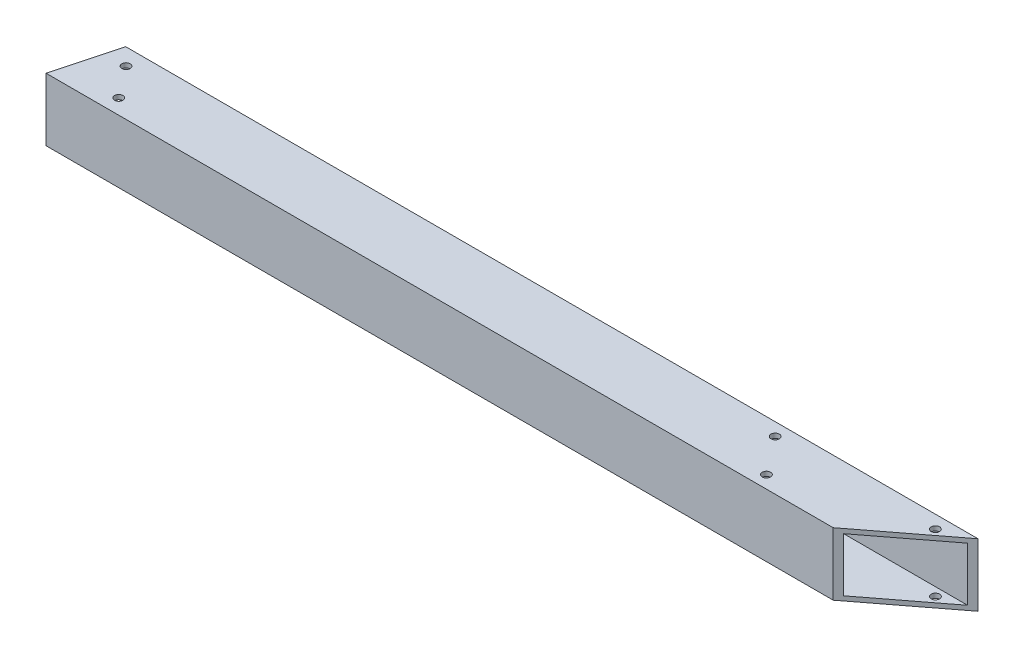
ISO-10303-21;
HEADER;
FILE_DESCRIPTION(('STEP AP214'),'2;1');
FILE_NAME('part.step','',(''),(''),'','','');
FILE_SCHEMA(('AUTOMOTIVE_DESIGN { 1 0 10303 214 1 1 1 1 }'));
ENDSEC;
DATA;
#1=APPLICATION_CONTEXT('core data for automotive mechanical design processes');
#2=APPLICATION_PROTOCOL_DEFINITION('international standard','automotive_design',2000,#1);
#3=PRODUCT_CONTEXT('',#1,'mechanical');
#4=PRODUCT('Part','Part','',(#3));
#5=PRODUCT_RELATED_PRODUCT_CATEGORY('part','',(#4));
#6=PRODUCT_DEFINITION_FORMATION('','',#4);
#7=PRODUCT_DEFINITION_CONTEXT('part definition',#1,'design');
#8=PRODUCT_DEFINITION('design','',#6,#7);
#9=PRODUCT_DEFINITION_SHAPE('','',#8);
#10=(LENGTH_UNIT() NAMED_UNIT(*) SI_UNIT(.MILLI.,.METRE.));
#11=(NAMED_UNIT(*) PLANE_ANGLE_UNIT() SI_UNIT($,.RADIAN.));
#12=(NAMED_UNIT(*) SI_UNIT($,.STERADIAN.) SOLID_ANGLE_UNIT());
#13=UNCERTAINTY_MEASURE_WITH_UNIT(LENGTH_MEASURE(1.E-05),#10,'distance_accuracy_value','');
#14=(GEOMETRIC_REPRESENTATION_CONTEXT(3) GLOBAL_UNCERTAINTY_ASSIGNED_CONTEXT((#13)) GLOBAL_UNIT_ASSIGNED_CONTEXT((#10,
#11,#12)) REPRESENTATION_CONTEXT('',''));
#15=CARTESIAN_POINT('',(0.,0.,0.));
#16=DIRECTION('',(0.,0.,1.));
#17=DIRECTION('',(1.,0.,0.));
#18=AXIS2_PLACEMENT_3D('',#15,#16,#17);
#19=CARTESIAN_POINT('',(3048.,-5.82867087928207E-13,-1.33226762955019E-12));
#20=DIRECTION('',(0.,0.,-0.999999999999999));
#21=DIRECTION('',(-1.,0.,0.));
#22=AXIS2_PLACEMENT_3D('',#19,#20,#21);
#23=PLANE('',#22);
#24=DIRECTION('',(-1.,0.,0.));
#25=VECTOR('',#24,1.);
#26=CARTESIAN_POINT('',(3048.,50.7999999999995,-1.33226762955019E-12));
#27=LINE('',#26,#25);
#28=CARTESIAN_POINT('',(1378.39812302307,50.7999999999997,-4.44089209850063E-13));
#29=VERTEX_POINT('',#28);
#30=CARTESIAN_POINT('',(741.814766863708,50.7999999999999,4.44089209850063E-13));
#31=VERTEX_POINT('',#30);
#32=EDGE_CURVE('E117',#29,#31,#27,.T.);
#33=ORIENTED_EDGE('',*,*,#32,.T.);
#34=DIRECTION('',(0.,-1.,0.));
#35=VECTOR('',#34,1.);
#36=CARTESIAN_POINT('',(741.814766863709,-1.38777878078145E-13,0.));
#37=LINE('',#36,#35);
#38=CARTESIAN_POINT('',(741.814766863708,-1.38777878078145E-13,4.44089209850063E-13));
#39=VERTEX_POINT('',#38);
#40=EDGE_CURVE('E46',#31,#39,#37,.T.);
#41=ORIENTED_EDGE('',*,*,#40,.T.);
#42=DIRECTION('',(-1.,0.,0.));
#43=VECTOR('',#42,1.);
#44=CARTESIAN_POINT('',(3048.,-5.82867087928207E-13,-1.33226762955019E-12));
#45=LINE('',#44,#43);
#46=CARTESIAN_POINT('',(1378.39812302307,-2.4980018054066E-13,-4.44089209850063E-13));
#47=VERTEX_POINT('',#46);
#48=EDGE_CURVE('E38',#47,#39,#45,.T.);
#49=ORIENTED_EDGE('',*,*,#48,.F.);
#50=DIRECTION('',(0.,1.,0.));
#51=VECTOR('',#50,1.);
#52=CARTESIAN_POINT('',(1378.39812302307,-2.4980018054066E-13,0.));
#53=LINE('',#52,#51);
#54=EDGE_CURVE('E196',#47,#29,#53,.T.);
#55=ORIENTED_EDGE('',*,*,#54,.T.);
#56=EDGE_LOOP('',(#33,#41,#49,#55));
#57=FACE_BOUND('',#56,.T.);
#58=ADVANCED_FACE('F30',(#57),#23,.F.);
#59=CARTESIAN_POINT('',(3048.,-5.82867087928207E-13,-1.33226762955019E-12));
#60=DIRECTION('',(0.,1.,0.));
#61=DIRECTION('',(0.,0.,0.999999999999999));
#62=AXIS2_PLACEMENT_3D('',#59,#60,#61);
#63=PLANE('',#62);
#64=CARTESIAN_POINT('',(1291.08437322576,-2.4980018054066E-13,-40.4220346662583));
#65=DIRECTION('',(0.,1.,0.));
#66=DIRECTION('',(0.,0.,0.999999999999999));
#67=AXIS2_PLACEMENT_3D('',#64,#65,#66);
#68=CIRCLE('',#67,3.37311999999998);
#69=CARTESIAN_POINT('',(1291.08437322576,-2.49804092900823E-13,-37.0489146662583));
#70=VERTEX_POINT('',#69);
#71=EDGE_CURVE('E299',#70,#70,#68,.T.);
#72=ORIENTED_EDGE('',*,*,#71,.T.);
#73=EDGE_LOOP('',(#72));
#74=FACE_BOUND('',#73,.T.);
#75=CARTESIAN_POINT('',(1314.25287542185,-2.4980018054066E-13,-10.1758695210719));
#76=DIRECTION('',(0.,1.,0.));
#77=DIRECTION('',(0.,0.,0.999999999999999));
#78=AXIS2_PLACEMENT_3D('',#75,#76,#77);
#79=CIRCLE('',#78,3.37311999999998);
#80=CARTESIAN_POINT('',(1314.25287542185,-2.49804092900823E-13,-6.80274952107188));
#81=VERTEX_POINT('',#80);
#82=EDGE_CURVE('E142',#81,#81,#79,.T.);
#83=ORIENTED_EDGE('',*,*,#82,.T.);
#84=EDGE_LOOP('',(#83));
#85=FACE_BOUND('',#84,.T.);
#86=CARTESIAN_POINT('',(1420.7785352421,-2.77555756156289E-13,-40.2814852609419));
#87=DIRECTION('',(0.,1.,0.));
#88=DIRECTION('',(0.,0.,0.999999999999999));
#89=AXIS2_PLACEMENT_3D('',#86,#87,#88);
#90=CIRCLE('',#89,3.37311999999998);
#91=CARTESIAN_POINT('',(1420.7785352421,-2.77559668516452E-13,-36.9083652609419));
#92=VERTEX_POINT('',#91);
#93=EDGE_CURVE('E138',#92,#92,#90,.T.);
#94=ORIENTED_EDGE('',*,*,#93,.T.);
#95=EDGE_LOOP('',(#94));
#96=FACE_BOUND('',#95,.T.);
#97=CARTESIAN_POINT('',(769.229859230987,-1.38777878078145E-13,-37.3068366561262));
#98=DIRECTION('',(0.,1.,0.));
#99=DIRECTION('',(0.,0.,0.999999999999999));
#100=AXIS2_PLACEMENT_3D('',#97,#98,#99);
#101=CIRCLE('',#100,3.37311999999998);
#102=CARTESIAN_POINT('',(769.229859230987,-1.38781790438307E-13,-33.9337166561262));
#103=VERTEX_POINT('',#102);
#104=EDGE_CURVE('E134',#103,#103,#101,.T.);
#105=ORIENTED_EDGE('',*,*,#104,.T.);
#106=EDGE_LOOP('',(#105));
#107=FACE_BOUND('',#106,.T.);
#108=CARTESIAN_POINT('',(788.536944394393,-1.52655665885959E-13,-12.1016990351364));
#109=DIRECTION('',(0.,1.,0.));
#110=DIRECTION('',(0.,0.,0.999999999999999));
#111=AXIS2_PLACEMENT_3D('',#108,#109,#110);
#112=CIRCLE('',#111,3.37311999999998);
#113=CARTESIAN_POINT('',(788.536944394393,-1.52659578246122E-13,-8.72857903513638));
#114=VERTEX_POINT('',#113);
#115=EDGE_CURVE('E129',#114,#114,#112,.T.);
#116=ORIENTED_EDGE('',*,*,#115,.T.);
#117=EDGE_LOOP('',(#116));
#118=FACE_BOUND('',#117,.T.);
#119=ORIENTED_EDGE('',*,*,#48,.T.);
#120=DIRECTION('',(0.260435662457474,0.,-0.965491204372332));
#121=VECTOR('',#120,1.);
#122=CARTESIAN_POINT('',(736.645884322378,-1.52655665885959E-13,19.1621630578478));
#123=LINE('',#122,#121);
#124=CARTESIAN_POINT('',(755.517772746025,-1.38777878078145E-13,-50.7999999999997));
#125=VERTEX_POINT('',#124);
#126=EDGE_CURVE('E101',#39,#125,#123,.T.);
#127=ORIENTED_EDGE('',*,*,#126,.T.);
#128=DIRECTION('',(-1.,0.,0.));
#129=VECTOR('',#128,1.);
#130=CARTESIAN_POINT('',(3048.,-5.82867087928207E-13,-50.8000000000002));
#131=LINE('',#130,#129);
#132=CARTESIAN_POINT('',(1444.71683350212,-2.77555756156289E-13,-50.8000000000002));
#133=VERTEX_POINT('',#132);
#134=EDGE_CURVE('E111',#133,#125,#131,.T.);
#135=ORIENTED_EDGE('',*,*,#134,.F.);
#136=DIRECTION('',(0.793862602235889,0.,-0.608097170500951));
#137=VECTOR('',#136,1.);
#138=CARTESIAN_POINT('',(1444.71683350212,-2.77555756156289E-13,-50.8000000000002));
#139=LINE('',#138,#137);
#140=EDGE_CURVE('E185',#47,#133,#139,.T.);
#141=ORIENTED_EDGE('',*,*,#140,.F.);
#142=EDGE_LOOP('',(#119,#127,#135,#141));
#143=FACE_BOUND('',#142,.T.);
#144=ADVANCED_FACE('F236',(#74,#85,#96,#107,#118,#143),#63,.F.);
#145=CARTESIAN_POINT('',(3048.,-5.82867087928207E-13,-50.8000000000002));
#146=DIRECTION('',(0.,0.,0.999999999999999));
#147=DIRECTION('',(1.,0.,0.));
#148=AXIS2_PLACEMENT_3D('',#145,#146,#147);
#149=PLANE('',#148);
#150=ORIENTED_EDGE('',*,*,#134,.T.);
#151=DIRECTION('',(0.,1.,0.));
#152=VECTOR('',#151,1.);
#153=CARTESIAN_POINT('',(755.517772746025,-1.38777878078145E-13,-50.7999999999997));
#154=LINE('',#153,#152);
#155=CARTESIAN_POINT('',(755.517772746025,50.7999999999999,-50.7999999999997));
#156=VERTEX_POINT('',#155);
#157=EDGE_CURVE('E95',#125,#156,#154,.T.);
#158=ORIENTED_EDGE('',*,*,#157,.T.);
#159=DIRECTION('',(-1.,0.,0.));
#160=VECTOR('',#159,1.);
#161=CARTESIAN_POINT('',(3048.,50.7999999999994,-50.8000000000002));
#162=LINE('',#161,#160);
#163=CARTESIAN_POINT('',(1444.71683350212,50.7999999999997,-50.8000000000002));
#164=VERTEX_POINT('',#163);
#165=EDGE_CURVE('E109',#164,#156,#162,.T.);
#166=ORIENTED_EDGE('',*,*,#165,.F.);
#167=DIRECTION('',(0.,-1.,0.));
#168=VECTOR('',#167,1.);
#169=CARTESIAN_POINT('',(1444.71683350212,50.7999999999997,-50.8000000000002));
#170=LINE('',#169,#168);
#171=EDGE_CURVE('E199',#164,#133,#170,.T.);
#172=ORIENTED_EDGE('',*,*,#171,.T.);
#173=EDGE_LOOP('',(#150,#158,#166,#172));
#174=FACE_BOUND('',#173,.T.);
#175=ADVANCED_FACE('F107',(#174),#149,.F.);
#176=CARTESIAN_POINT('',(3048.,50.7999999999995,-1.33226762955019E-12));
#177=DIRECTION('',(0.,-1.,0.));
#178=DIRECTION('',(0.,0.,-0.999999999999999));
#179=AXIS2_PLACEMENT_3D('',#176,#177,#178);
#180=PLANE('',#179);
#181=CARTESIAN_POINT('',(1291.08437322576,50.7999999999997,-40.4220346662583));
#182=DIRECTION('',(0.,1.,0.));
#183=DIRECTION('',(0.,0.,0.999999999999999));
#184=AXIS2_PLACEMENT_3D('',#181,#182,#183);
#185=CIRCLE('',#184,3.37311999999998);
#186=CARTESIAN_POINT('',(1291.08437322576,50.7999999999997,-37.0489146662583));
#187=VERTEX_POINT('',#186);
#188=EDGE_CURVE('E298',#187,#187,#185,.T.);
#189=ORIENTED_EDGE('',*,*,#188,.F.);
#190=EDGE_LOOP('',(#189));
#191=FACE_BOUND('',#190,.T.);
#192=CARTESIAN_POINT('',(1314.25287542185,50.7999999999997,-10.1758695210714));
#193=DIRECTION('',(0.,1.,0.));
#194=DIRECTION('',(0.,0.,0.999999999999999));
#195=AXIS2_PLACEMENT_3D('',#192,#193,#194);
#196=CIRCLE('',#195,3.37311999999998);
#197=CARTESIAN_POINT('',(1314.25287542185,50.7999999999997,-6.80274952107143));
#198=VERTEX_POINT('',#197);
#199=EDGE_CURVE('E149',#198,#198,#196,.T.);
#200=ORIENTED_EDGE('',*,*,#199,.F.);
#201=EDGE_LOOP('',(#200));
#202=FACE_BOUND('',#201,.T.);
#203=CARTESIAN_POINT('',(1420.7785352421,50.7999999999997,-40.2814852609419));
#204=DIRECTION('',(0.,1.,0.));
#205=DIRECTION('',(0.,0.,0.999999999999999));
#206=AXIS2_PLACEMENT_3D('',#203,#204,#205);
#207=CIRCLE('',#206,3.37311999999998);
#208=CARTESIAN_POINT('',(1420.7785352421,50.7999999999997,-36.9083652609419));
#209=VERTEX_POINT('',#208);
#210=EDGE_CURVE('E146',#209,#209,#207,.T.);
#211=ORIENTED_EDGE('',*,*,#210,.F.);
#212=EDGE_LOOP('',(#211));
#213=FACE_BOUND('',#212,.T.);
#214=CARTESIAN_POINT('',(769.229859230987,50.7999999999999,-37.3068366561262));
#215=DIRECTION('',(0.,1.,0.));
#216=DIRECTION('',(0.,0.,0.999999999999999));
#217=AXIS2_PLACEMENT_3D('',#214,#215,#216);
#218=CIRCLE('',#217,3.37311999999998);
#219=CARTESIAN_POINT('',(769.229859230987,50.7999999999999,-33.9337166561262));
#220=VERTEX_POINT('',#219);
#221=EDGE_CURVE('E165',#220,#220,#218,.T.);
#222=ORIENTED_EDGE('',*,*,#221,.F.);
#223=EDGE_LOOP('',(#222));
#224=FACE_BOUND('',#223,.T.);
#225=CARTESIAN_POINT('',(788.536944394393,50.7999999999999,-12.1016990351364));
#226=DIRECTION('',(0.,1.,0.));
#227=DIRECTION('',(0.,0.,0.999999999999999));
#228=AXIS2_PLACEMENT_3D('',#225,#226,#227);
#229=CIRCLE('',#228,3.37311999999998);
#230=CARTESIAN_POINT('',(788.536944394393,50.7999999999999,-8.72857903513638));
#231=VERTEX_POINT('',#230);
#232=EDGE_CURVE('E172',#231,#231,#229,.T.);
#233=ORIENTED_EDGE('',*,*,#232,.F.);
#234=EDGE_LOOP('',(#233));
#235=FACE_BOUND('',#234,.T.);
#236=ORIENTED_EDGE('',*,*,#165,.T.);
#237=DIRECTION('',(0.260435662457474,0.,-0.965491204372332));
#238=VECTOR('',#237,1.);
#239=CARTESIAN_POINT('',(736.645884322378,50.7999999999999,19.1621630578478));
#240=LINE('',#239,#238);
#241=EDGE_CURVE('E92',#31,#156,#240,.T.);
#242=ORIENTED_EDGE('',*,*,#241,.F.);
#243=ORIENTED_EDGE('',*,*,#32,.F.);
#244=DIRECTION('',(0.793862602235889,0.,-0.608097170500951));
#245=VECTOR('',#244,1.);
#246=CARTESIAN_POINT('',(1444.71683350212,50.7999999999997,-50.8000000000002));
#247=LINE('',#246,#245);
#248=EDGE_CURVE('E116',#29,#164,#247,.T.);
#249=ORIENTED_EDGE('',*,*,#248,.T.);
#250=EDGE_LOOP('',(#236,#242,#243,#249));
#251=FACE_BOUND('',#250,.T.);
#252=ADVANCED_FACE('F115',(#191,#202,#213,#224,#235,#251),#180,.F.);
#253=CARTESIAN_POINT('',(3048.,47.1423999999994,-3.65760000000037));
#254=DIRECTION('',(0.,0.,-0.999999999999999));
#255=DIRECTION('',(0.,1.,0.));
#256=AXIS2_PLACEMENT_3D('',#253,#254,#255);
#257=PLANE('',#256);
#258=DIRECTION('',(0.,-1.,0.));
#259=VECTOR('',#258,1.);
#260=CARTESIAN_POINT('',(742.801383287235,47.1423999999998,-3.65759999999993));
#261=LINE('',#260,#259);
#262=CARTESIAN_POINT('',(742.801383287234,47.1423999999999,-3.65759999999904));
#263=VERTEX_POINT('',#262);
#264=CARTESIAN_POINT('',(742.801383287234,3.65759999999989,-3.65759999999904));
#265=VERTEX_POINT('',#264);
#266=EDGE_CURVE('E112',#263,#265,#261,.T.);
#267=ORIENTED_EDGE('',*,*,#266,.F.);
#268=DIRECTION('',(-1.,0.,0.));
#269=VECTOR('',#268,1.);
#270=CARTESIAN_POINT('',(3048.,47.1423999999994,-3.65760000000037));
#271=LINE('',#270,#269);
#272=CARTESIAN_POINT('',(1383.17307017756,47.1423999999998,-3.65759999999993));
#273=VERTEX_POINT('',#272);
#274=EDGE_CURVE('E201',#273,#263,#271,.T.);
#275=ORIENTED_EDGE('',*,*,#274,.F.);
#276=DIRECTION('',(0.,1.,0.));
#277=VECTOR('',#276,1.);
#278=CARTESIAN_POINT('',(1383.17307017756,47.1423999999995,-3.65759999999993));
#279=LINE('',#278,#277);
#280=CARTESIAN_POINT('',(1383.17307017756,3.65759999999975,-3.65759999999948));
#281=VERTEX_POINT('',#280);
#282=EDGE_CURVE('E194',#281,#273,#279,.T.);
#283=ORIENTED_EDGE('',*,*,#282,.F.);
#284=DIRECTION('',(-1.,0.,0.));
#285=VECTOR('',#284,1.);
#286=CARTESIAN_POINT('',(3048.,3.65759999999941,-3.65760000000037));
#287=LINE('',#286,#285);
#288=EDGE_CURVE('E120',#281,#265,#287,.T.);
#289=ORIENTED_EDGE('',*,*,#288,.T.);
#290=EDGE_LOOP('',(#267,#275,#283,#289));
#291=FACE_BOUND('',#290,.T.);
#292=ADVANCED_FACE('F214',(#291),#257,.T.);
#293=CARTESIAN_POINT('',(3048.,3.65759999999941,-3.65760000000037));
#294=DIRECTION('',(0.,1.,0.));
#295=DIRECTION('',(0.,0.,0.999999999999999));
#296=AXIS2_PLACEMENT_3D('',#293,#294,#295);
#297=PLANE('',#296);
#298=CARTESIAN_POINT('',(1291.08437322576,3.65759999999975,-40.4220346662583));
#299=DIRECTION('',(0.,1.,0.));
#300=DIRECTION('',(0.,0.,0.999999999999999));
#301=AXIS2_PLACEMENT_3D('',#298,#299,#300);
#302=CIRCLE('',#301,3.37311999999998);
#303=CARTESIAN_POINT('',(1291.08437322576,3.65759999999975,-37.0489146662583));
#304=VERTEX_POINT('',#303);
#305=EDGE_CURVE('E154',#304,#304,#302,.T.);
#306=ORIENTED_EDGE('',*,*,#305,.F.);
#307=EDGE_LOOP('',(#306));
#308=FACE_BOUND('',#307,.T.);
#309=CARTESIAN_POINT('',(1314.25287542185,3.65759999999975,-10.1758695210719));
#310=DIRECTION('',(0.,1.,0.));
#311=DIRECTION('',(0.,0.,0.999999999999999));
#312=AXIS2_PLACEMENT_3D('',#309,#310,#311);
#313=CIRCLE('',#312,3.37311999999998);
#314=CARTESIAN_POINT('',(1314.25287542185,3.65759999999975,-6.80274952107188));
#315=VERTEX_POINT('',#314);
#316=EDGE_CURVE('E141',#315,#315,#313,.T.);
#317=ORIENTED_EDGE('',*,*,#316,.F.);
#318=EDGE_LOOP('',(#317));
#319=FACE_BOUND('',#318,.T.);
#320=CARTESIAN_POINT('',(1420.7785352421,3.65759999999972,-40.2814852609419));
#321=DIRECTION('',(0.,1.,0.));
#322=DIRECTION('',(0.,0.,0.999999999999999));
#323=AXIS2_PLACEMENT_3D('',#320,#321,#322);
#324=CIRCLE('',#323,3.37311999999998);
#325=CARTESIAN_POINT('',(1420.7785352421,3.65759999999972,-36.9083652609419));
#326=VERTEX_POINT('',#325);
#327=EDGE_CURVE('E137',#326,#326,#324,.T.);
#328=ORIENTED_EDGE('',*,*,#327,.F.);
#329=EDGE_LOOP('',(#328));
#330=FACE_BOUND('',#329,.T.);
#331=CARTESIAN_POINT('',(769.229859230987,3.65759999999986,-37.3068366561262));
#332=DIRECTION('',(0.,1.,0.));
#333=DIRECTION('',(0.,0.,0.999999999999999));
#334=AXIS2_PLACEMENT_3D('',#331,#332,#333);
#335=CIRCLE('',#334,3.37311999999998);
#336=CARTESIAN_POINT('',(769.229859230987,3.65759999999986,-33.9337166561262));
#337=VERTEX_POINT('',#336);
#338=EDGE_CURVE('E133',#337,#337,#335,.T.);
#339=ORIENTED_EDGE('',*,*,#338,.F.);
#340=EDGE_LOOP('',(#339));
#341=FACE_BOUND('',#340,.T.);
#342=CARTESIAN_POINT('',(788.536944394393,3.65759999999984,-12.1016990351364));
#343=DIRECTION('',(0.,1.,0.));
#344=DIRECTION('',(0.,0.,0.999999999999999));
#345=AXIS2_PLACEMENT_3D('',#342,#343,#344);
#346=CIRCLE('',#345,3.37311999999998);
#347=CARTESIAN_POINT('',(788.536944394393,3.65759999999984,-8.72857903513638));
#348=VERTEX_POINT('',#347);
#349=EDGE_CURVE('E102',#348,#348,#346,.T.);
#350=ORIENTED_EDGE('',*,*,#349,.F.);
#351=EDGE_LOOP('',(#350));
#352=FACE_BOUND('',#351,.T.);
#353=DIRECTION('',(0.260435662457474,0.,-0.965491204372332));
#354=VECTOR('',#353,1.);
#355=CARTESIAN_POINT('',(899.155477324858,3.65759999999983,-583.295968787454));
#356=LINE('',#355,#354);
#357=CARTESIAN_POINT('',(754.531156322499,3.65759999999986,-47.1423999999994));
#358=VERTEX_POINT('',#357);
#359=EDGE_CURVE('E181',#265,#358,#356,.T.);
#360=ORIENTED_EDGE('',*,*,#359,.F.);
#361=ORIENTED_EDGE('',*,*,#288,.F.);
#362=DIRECTION('',(-0.793862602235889,0.,0.608097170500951));
#363=VECTOR('',#362,1.);
#364=CARTESIAN_POINT('',(2432.37668726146,3.65759999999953,-807.345478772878));
#365=LINE('',#364,#363);
#366=CARTESIAN_POINT('',(1439.94188634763,3.65759999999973,-47.1423999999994));
#367=VERTEX_POINT('',#366);
#368=EDGE_CURVE('E192',#367,#281,#365,.T.);
#369=ORIENTED_EDGE('',*,*,#368,.F.);
#370=DIRECTION('',(-1.,0.,0.));
#371=VECTOR('',#370,1.);
#372=CARTESIAN_POINT('',(3048.,3.65759999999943,-47.1424000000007));
#373=LINE('',#372,#371);
#374=EDGE_CURVE('E207',#367,#358,#373,.T.);
#375=ORIENTED_EDGE('',*,*,#374,.T.);
#376=EDGE_LOOP('',(#360,#361,#369,#375));
#377=FACE_BOUND('',#376,.T.);
#378=ADVANCED_FACE('F219',(#308,#319,#330,#341,#352,#377),#297,.T.);
#379=CARTESIAN_POINT('',(3048.,47.1423999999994,-47.1424000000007));
#380=DIRECTION('',(0.,0.,0.999999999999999));
#381=DIRECTION('',(0.,-1.,0.));
#382=AXIS2_PLACEMENT_3D('',#379,#380,#381);
#383=PLANE('',#382);
#384=DIRECTION('',(0.,1.,0.));
#385=VECTOR('',#384,1.);
#386=CARTESIAN_POINT('',(754.531156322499,47.1423999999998,-47.1423999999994));
#387=LINE('',#386,#385);
#388=CARTESIAN_POINT('',(754.531156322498,47.1423999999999,-47.1423999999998));
#389=VERTEX_POINT('',#388);
#390=EDGE_CURVE('E53',#358,#389,#387,.T.);
#391=ORIENTED_EDGE('',*,*,#390,.F.);
#392=ORIENTED_EDGE('',*,*,#374,.F.);
#393=DIRECTION('',(0.,-1.,0.));
#394=VECTOR('',#393,1.);
#395=CARTESIAN_POINT('',(1439.94188634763,47.1423999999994,-47.1423999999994));
#396=LINE('',#395,#394);
#397=CARTESIAN_POINT('',(1439.94188634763,47.1423999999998,-47.1423999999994));
#398=VERTEX_POINT('',#397);
#399=EDGE_CURVE('E190',#398,#367,#396,.T.);
#400=ORIENTED_EDGE('',*,*,#399,.F.);
#401=DIRECTION('',(-1.,0.,0.));
#402=VECTOR('',#401,1.);
#403=CARTESIAN_POINT('',(3048.,47.1423999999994,-47.1424000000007));
#404=LINE('',#403,#402);
#405=EDGE_CURVE('E204',#398,#389,#404,.T.);
#406=ORIENTED_EDGE('',*,*,#405,.T.);
#407=EDGE_LOOP('',(#391,#392,#400,#406));
#408=FACE_BOUND('',#407,.T.);
#409=ADVANCED_FACE('F222',(#408),#383,.T.);
#410=CARTESIAN_POINT('',(3048.,47.1423999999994,-3.65760000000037));
#411=DIRECTION('',(0.,-1.,0.));
#412=DIRECTION('',(0.,0.,-0.999999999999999));
#413=AXIS2_PLACEMENT_3D('',#410,#411,#412);
#414=PLANE('',#413);
#415=CARTESIAN_POINT('',(1291.08437322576,47.1423999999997,-40.4220346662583));
#416=DIRECTION('',(0.,-1.,0.));
#417=DIRECTION('',(0.,0.,-0.999999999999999));
#418=AXIS2_PLACEMENT_3D('',#415,#416,#417);
#419=CIRCLE('',#418,3.37311999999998);
#420=CARTESIAN_POINT('',(1291.08437322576,47.1423999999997,-43.7951546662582));
#421=VERTEX_POINT('',#420);
#422=EDGE_CURVE('E33',#421,#421,#419,.T.);
#423=ORIENTED_EDGE('',*,*,#422,.F.);
#424=EDGE_LOOP('',(#423));
#425=FACE_BOUND('',#424,.T.);
#426=CARTESIAN_POINT('',(1314.25287542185,47.1423999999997,-10.1758695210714));
#427=DIRECTION('',(0.,-1.,0.));
#428=DIRECTION('',(0.,0.,-0.999999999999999));
#429=AXIS2_PLACEMENT_3D('',#426,#427,#428);
#430=CIRCLE('',#429,3.37311999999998);
#431=CARTESIAN_POINT('',(1314.25287542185,47.1423999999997,-13.5489895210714));
#432=VERTEX_POINT('',#431);
#433=EDGE_CURVE('E139',#432,#432,#430,.T.);
#434=ORIENTED_EDGE('',*,*,#433,.F.);
#435=EDGE_LOOP('',(#434));
#436=FACE_BOUND('',#435,.T.);
#437=CARTESIAN_POINT('',(1420.7785352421,47.1423999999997,-40.2814852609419));
#438=DIRECTION('',(0.,-1.,0.));
#439=DIRECTION('',(0.,0.,-0.999999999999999));
#440=AXIS2_PLACEMENT_3D('',#437,#438,#439);
#441=CIRCLE('',#440,3.37311999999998);
#442=CARTESIAN_POINT('',(1420.7785352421,47.1423999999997,-43.6546052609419));
#443=VERTEX_POINT('',#442);
#444=EDGE_CURVE('E135',#443,#443,#441,.T.);
#445=ORIENTED_EDGE('',*,*,#444,.F.);
#446=EDGE_LOOP('',(#445));
#447=FACE_BOUND('',#446,.T.);
#448=CARTESIAN_POINT('',(769.229859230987,47.1423999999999,-37.3068366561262));
#449=DIRECTION('',(0.,-1.,0.));
#450=DIRECTION('',(0.,0.,-0.999999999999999));
#451=AXIS2_PLACEMENT_3D('',#448,#449,#450);
#452=CIRCLE('',#451,3.37311999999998);
#453=CARTESIAN_POINT('',(769.229859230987,47.1423999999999,-40.6799566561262));
#454=VERTEX_POINT('',#453);
#455=EDGE_CURVE('E130',#454,#454,#452,.T.);
#456=ORIENTED_EDGE('',*,*,#455,.F.);
#457=EDGE_LOOP('',(#456));
#458=FACE_BOUND('',#457,.T.);
#459=CARTESIAN_POINT('',(788.536944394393,47.1423999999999,-12.1016990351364));
#460=DIRECTION('',(0.,-1.,0.));
#461=DIRECTION('',(0.,0.,-0.999999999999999));
#462=AXIS2_PLACEMENT_3D('',#459,#460,#461);
#463=CIRCLE('',#462,3.37311999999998);
#464=CARTESIAN_POINT('',(788.536944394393,47.1423999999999,-15.4748190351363));
#465=VERTEX_POINT('',#464);
#466=EDGE_CURVE('E126',#465,#465,#463,.T.);
#467=ORIENTED_EDGE('',*,*,#466,.F.);
#468=EDGE_LOOP('',(#467));
#469=FACE_BOUND('',#468,.T.);
#470=DIRECTION('',(-0.260435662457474,0.,0.965491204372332));
#471=VECTOR('',#470,1.);
#472=CARTESIAN_POINT('',(899.155477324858,47.1423999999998,-583.295968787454));
#473=LINE('',#472,#471);
#474=EDGE_CURVE('E11',#389,#263,#473,.T.);
#475=ORIENTED_EDGE('',*,*,#474,.F.);
#476=ORIENTED_EDGE('',*,*,#405,.F.);
#477=DIRECTION('',(0.793862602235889,0.,-0.608097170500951));
#478=VECTOR('',#477,1.);
#479=CARTESIAN_POINT('',(2432.37668726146,47.1423999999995,-807.345478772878));
#480=LINE('',#479,#478);
#481=EDGE_CURVE('E187',#273,#398,#480,.T.);
#482=ORIENTED_EDGE('',*,*,#481,.F.);
#483=ORIENTED_EDGE('',*,*,#274,.T.);
#484=EDGE_LOOP('',(#475,#476,#482,#483));
#485=FACE_BOUND('',#484,.T.);
#486=ADVANCED_FACE('F227',(#425,#436,#447,#458,#469,#485),#414,.T.);
#487=CARTESIAN_POINT('',(1444.71683350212,50.7999999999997,-50.8000000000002));
#488=DIRECTION('',(-0.608097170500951,0.,-0.793862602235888));
#489=DIRECTION('',(-0.793862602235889,0.,0.608097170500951));
#490=AXIS2_PLACEMENT_3D('',#487,#488,#489);
#491=PLANE('',#490);
#492=ORIENTED_EDGE('',*,*,#282,.T.);
#493=ORIENTED_EDGE('',*,*,#481,.T.);
#494=ORIENTED_EDGE('',*,*,#399,.T.);
#495=ORIENTED_EDGE('',*,*,#368,.T.);
#496=EDGE_LOOP('',(#492,#493,#494,#495));
#497=FACE_BOUND('',#496,.T.);
#498=ORIENTED_EDGE('',*,*,#140,.T.);
#499=ORIENTED_EDGE('',*,*,#171,.F.);
#500=ORIENTED_EDGE('',*,*,#248,.F.);
#501=ORIENTED_EDGE('',*,*,#54,.F.);
#502=EDGE_LOOP('',(#498,#499,#500,#501));
#503=FACE_BOUND('',#502,.T.);
#504=ADVANCED_FACE('F229',(#497,#503),#491,.F.);
#505=CARTESIAN_POINT('',(736.645884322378,-1.52655665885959E-13,19.1621630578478));
#506=DIRECTION('',(0.965491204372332,0.,0.260435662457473));
#507=DIRECTION('',(0.260435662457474,0.,-0.965491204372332));
#508=AXIS2_PLACEMENT_3D('',#505,#506,#507);
#509=PLANE('',#508);
#510=ORIENTED_EDGE('',*,*,#266,.T.);
#511=ORIENTED_EDGE('',*,*,#359,.T.);
#512=ORIENTED_EDGE('',*,*,#390,.T.);
#513=ORIENTED_EDGE('',*,*,#474,.T.);
#514=EDGE_LOOP('',(#510,#511,#512,#513));
#515=FACE_BOUND('',#514,.T.);
#516=ORIENTED_EDGE('',*,*,#241,.T.);
#517=ORIENTED_EDGE('',*,*,#157,.F.);
#518=ORIENTED_EDGE('',*,*,#126,.F.);
#519=ORIENTED_EDGE('',*,*,#40,.F.);
#520=EDGE_LOOP('',(#516,#517,#518,#519));
#521=FACE_BOUND('',#520,.T.);
#522=ADVANCED_FACE('F94',(#515,#521),#509,.F.);
#523=CARTESIAN_POINT('',(788.536944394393,-1.52655665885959E-13,-12.1016990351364));
#524=DIRECTION('',(0.,1.,0.));
#525=DIRECTION('',(0.,0.,0.999999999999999));
#526=AXIS2_PLACEMENT_3D('',#523,#524,#525);
#527=CYLINDRICAL_SURFACE('',#526,3.37311999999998);
#528=ORIENTED_EDGE('',*,*,#466,.T.);
#529=EDGE_LOOP('',(#528));
#530=FACE_BOUND('',#529,.T.);
#531=ORIENTED_EDGE('',*,*,#232,.T.);
#532=EDGE_LOOP('',(#531));
#533=FACE_BOUND('',#532,.T.);
#534=ADVANCED_FACE('F264',(#530,#533),#527,.F.);
#535=ORIENTED_EDGE('',*,*,#349,.T.);
#536=EDGE_LOOP('',(#535));
#537=FACE_BOUND('',#536,.T.);
#538=ORIENTED_EDGE('',*,*,#115,.F.);
#539=EDGE_LOOP('',(#538));
#540=FACE_BOUND('',#539,.T.);
#541=ADVANCED_FACE('F267',(#537,#540),#527,.F.);
#542=CARTESIAN_POINT('',(769.229859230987,-1.38777878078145E-13,-37.3068366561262));
#543=DIRECTION('',(0.,1.,0.));
#544=DIRECTION('',(0.,0.,0.999999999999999));
#545=AXIS2_PLACEMENT_3D('',#542,#543,#544);
#546=CYLINDRICAL_SURFACE('',#545,3.37311999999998);
#547=ORIENTED_EDGE('',*,*,#455,.T.);
#548=EDGE_LOOP('',(#547));
#549=FACE_BOUND('',#548,.T.);
#550=ORIENTED_EDGE('',*,*,#221,.T.);
#551=EDGE_LOOP('',(#550));
#552=FACE_BOUND('',#551,.T.);
#553=ADVANCED_FACE('F269',(#549,#552),#546,.F.);
#554=ORIENTED_EDGE('',*,*,#338,.T.);
#555=EDGE_LOOP('',(#554));
#556=FACE_BOUND('',#555,.T.);
#557=ORIENTED_EDGE('',*,*,#104,.F.);
#558=EDGE_LOOP('',(#557));
#559=FACE_BOUND('',#558,.T.);
#560=ADVANCED_FACE('F272',(#556,#559),#546,.F.);
#561=CARTESIAN_POINT('',(1420.7785352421,-2.77555756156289E-13,-40.2814852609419));
#562=DIRECTION('',(0.,1.,0.));
#563=DIRECTION('',(0.,0.,0.999999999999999));
#564=AXIS2_PLACEMENT_3D('',#561,#562,#563);
#565=CYLINDRICAL_SURFACE('',#564,3.37311999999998);
#566=ORIENTED_EDGE('',*,*,#444,.T.);
#567=EDGE_LOOP('',(#566));
#568=FACE_BOUND('',#567,.T.);
#569=ORIENTED_EDGE('',*,*,#210,.T.);
#570=EDGE_LOOP('',(#569));
#571=FACE_BOUND('',#570,.T.);
#572=ADVANCED_FACE('F274',(#568,#571),#565,.F.);
#573=ORIENTED_EDGE('',*,*,#327,.T.);
#574=EDGE_LOOP('',(#573));
#575=FACE_BOUND('',#574,.T.);
#576=ORIENTED_EDGE('',*,*,#93,.F.);
#577=EDGE_LOOP('',(#576));
#578=FACE_BOUND('',#577,.T.);
#579=ADVANCED_FACE('F277',(#575,#578),#565,.F.);
#580=CARTESIAN_POINT('',(1314.25287542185,-2.4980018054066E-13,-10.1758695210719));
#581=DIRECTION('',(0.,1.,0.));
#582=DIRECTION('',(0.,0.,0.999999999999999));
#583=AXIS2_PLACEMENT_3D('',#580,#581,#582);
#584=CYLINDRICAL_SURFACE('',#583,3.37311999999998);
#585=ORIENTED_EDGE('',*,*,#433,.T.);
#586=EDGE_LOOP('',(#585));
#587=FACE_BOUND('',#586,.T.);
#588=ORIENTED_EDGE('',*,*,#199,.T.);
#589=EDGE_LOOP('',(#588));
#590=FACE_BOUND('',#589,.T.);
#591=ADVANCED_FACE('F279',(#587,#590),#584,.F.);
#592=ORIENTED_EDGE('',*,*,#316,.T.);
#593=EDGE_LOOP('',(#592));
#594=FACE_BOUND('',#593,.T.);
#595=ORIENTED_EDGE('',*,*,#82,.F.);
#596=EDGE_LOOP('',(#595));
#597=FACE_BOUND('',#596,.T.);
#598=ADVANCED_FACE('F282',(#594,#597),#584,.F.);
#599=CARTESIAN_POINT('',(1291.08437322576,-2.4980018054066E-13,-40.4220346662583));
#600=DIRECTION('',(0.,1.,0.));
#601=DIRECTION('',(0.,0.,0.999999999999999));
#602=AXIS2_PLACEMENT_3D('',#599,#600,#601);
#603=CYLINDRICAL_SURFACE('',#602,3.37311999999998);
#604=ORIENTED_EDGE('',*,*,#422,.T.);
#605=EDGE_LOOP('',(#604));
#606=FACE_BOUND('',#605,.T.);
#607=ORIENTED_EDGE('',*,*,#188,.T.);
#608=EDGE_LOOP('',(#607));
#609=FACE_BOUND('',#608,.T.);
#610=ADVANCED_FACE('F283',(#606,#609),#603,.F.);
#611=ORIENTED_EDGE('',*,*,#305,.T.);
#612=EDGE_LOOP('',(#611));
#613=FACE_BOUND('',#612,.T.);
#614=ORIENTED_EDGE('',*,*,#71,.F.);
#615=EDGE_LOOP('',(#614));
#616=FACE_BOUND('',#615,.T.);
#617=ADVANCED_FACE('F285',(#613,#616),#603,.F.);
#618=CLOSED_SHELL('',(#58,#144,#175,#252,#292,#378,#409,#486,#504,#522,#534,#541,#553,#560,#572,
#579,#591,#598,#610,#617));
#619=MANIFOLD_SOLID_BREP('B2',#618);
#620=ADVANCED_BREP_SHAPE_REPRESENTATION('',(#18,#619),#14);
#621=SHAPE_DEFINITION_REPRESENTATION(#9,#620);
ENDSEC;
END-ISO-10303-21;
